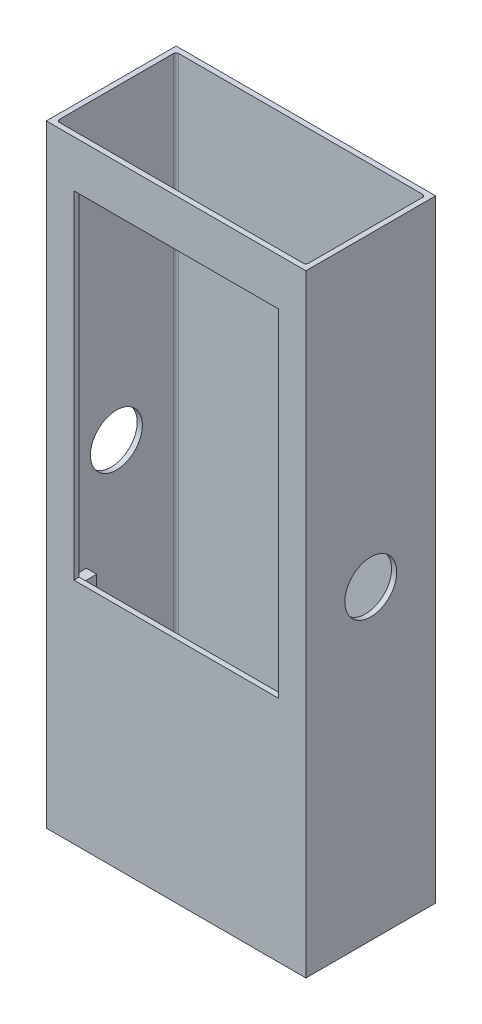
from build123d import *

# Parameters (mm, degrees)
SKETCH1_W               = 127
SKETCH1_H               = 63.5
BOSS_EXTRUDE1_DEPTH     = 302.26
SKETCH2_W               = 121.92
SKETCH2_H               = 58.42
CUT_EXTRUDE1_DEPTH      = 299.72
FILLET3_R               = 1.27
FILLET4_R               = 1.27
FILLET5_R               = 1.27
FILLET6_R               = 1.27
SKETCH3_R               = 12.7
CUT_EXTRUDE3_DEPTH      = 254
SKETCH4_W               = 127
SKETCH4_H               = 63.5
CUT_EXTRUDE4_DEPTH      = 2.54
CUT_EXTRUDE5_DEPTH      = 8.128
CUT_EXTRUDE5_DEPTH_BACK = 25.4
SKETCH5_W               = 100.000000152
SKETCH5_H               = 164.999999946
SKETCH6_R               = 1.600000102
BOSS_EXTRUDE3_DEPTH     = 8.000000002
BOSS_EXTRUDE4_DEPTH     = 7.99999924
BOSS_EXTRUDE5_DEPTH     = 7.99999924
BOSS_EXTRUDE6_DEPTH     = 7.99999924


with BuildPart() as part:
    # Sketch1 → Boss-Extrude1 (new body)
    with BuildSketch(Plane(origin=(0, 0, 0), x_dir=(1, 0, 0), z_dir=(0, 1, 0))):
        with Locations((63.5, 31.75)):
            Rectangle(SKETCH1_W, SKETCH1_H)
    extrude(amount=-BOSS_EXTRUDE1_DEPTH)

    # Sketch2 → Cut-Extrude1 (cut)
    with BuildSketch(Plane.XZ.offset(302.26)):
        with Locations((63.5, -31.75)):
            Rectangle(SKETCH2_W, SKETCH2_H)
    extrude(amount=-CUT_EXTRUDE1_DEPTH, mode=Mode.SUBTRACT)

    # Fillet3
    fillet3_edges = [part.edges().sort_by_distance(p)[0] for p in [
        (2.54, -152.4, -60.96),
    ]]
    fillet(fillet3_edges, radius=FILLET3_R)

    # Fillet4
    fillet4_edges = [part.edges().sort_by_distance(p)[0] for p in [
        (2.54, -152.4, -2.54),
    ]]
    fillet(fillet4_edges, radius=FILLET4_R)

    # Fillet5
    fillet5_edges = [part.edges().sort_by_distance(p)[0] for p in [
        (124.46, -152.4, -2.54),
    ]]
    fillet(fillet5_edges, radius=FILLET5_R)

    # Fillet6
    fillet6_edges = [part.edges().sort_by_distance(p)[0] for p in [
        (124.46, -152.4, -60.96),
    ]]
    fillet(fillet6_edges, radius=FILLET6_R)

    # Sketch3 → Cut-Extrude3 (cut)
    with BuildSketch(Plane.ZY):
        with Locations(Location((-31.75, -152.4, 0), (0, 0, 180))):
            Circle(SKETCH3_R)
    extrude(amount=-CUT_EXTRUDE3_DEPTH, mode=Mode.SUBTRACT)

    # Sketch4 → Cut-Extrude4 (cut)
    with BuildSketch(Plane(origin=(0, 0, 0), x_dir=(1, 0, 0), z_dir=(0, 1, 0))):
        with Locations((63.5, 31.75)):
            Rectangle(SKETCH4_W, SKETCH4_H)
    extrude(amount=-CUT_EXTRUDE4_DEPTH, mode=Mode.SUBTRACT)

    # Sketch5 → Cut-Extrude5 (cut, two sides: drawn at the far end of the back side and taken through both)
    with BuildSketch(Plane.XY.offset(-CUT_EXTRUDE5_DEPTH_BACK)):
        with Locations((63.5, -107.899999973)):
            Rectangle(SKETCH5_W, SKETCH5_H)
    extrude(amount=CUT_EXTRUDE5_DEPTH + CUT_EXTRUDE5_DEPTH_BACK, mode=Mode.SUBTRACT)

    # Sketch6 → Boss-Extrude3 (add)
    with BuildSketch(Plane(origin=(0, 0, -2.54), x_dir=(-1, 0, 0), z_dir=(0, 0, -1))):
        Polygon((-11.57603843, -17.860000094), (-9.03603843, -17.860000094), (-9.03603843, -22.940000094), (-14.11603843, -22.940000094), (-14.11603843, -17.860000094), align=None)
        with Locations((-11.57603843, -20.400000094)):
            Circle(SKETCH6_R, mode=Mode.SUBTRACT)
    extrude(amount=BOSS_EXTRUDE3_DEPTH)

    # Sketch8 → Boss-Extrude4 (add)
    with BuildSketch(Plane(origin=(0, 0, -2.54), x_dir=(-1, 0, 0), z_dir=(0, 0, -1))):
        with BuildLine():
            Line((-116.55537096, -19.268629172), (-117.964000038, -17.860000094))
            Line((-117.964000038, -17.860000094), (-117.964000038, -22.940000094))
            Line((-117.964000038, -22.940000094), (-116.55537096, -21.531371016))
            ThreePointArc((-116.55537096, -21.531371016), (-117.02400014, -20.400000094), (-116.55537096, -19.268629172))
        make_face()
        with BuildLine():
            Line((-114.292629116, -19.268629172), (-112.884000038, -17.860000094))
            Line((-112.884000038, -17.860000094), (-117.964000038, -17.860000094))
            Line((-117.964000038, -17.860000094), (-116.55537096, -19.268629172))
            ThreePointArc((-116.55537096, -19.268629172), (-115.424000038, -18.799999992), (-114.292629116, -19.268629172))
        make_face()
        with BuildLine():
            Line((-112.884000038, -22.940000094), (-112.884000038, -17.860000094))
            Line((-112.884000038, -17.860000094), (-114.292629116, -19.268629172))
            ThreePointArc((-114.292629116, -19.268629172), (-113.945792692, -19.787706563), (-113.823999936, -20.400000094))
            ThreePointArc((-113.823999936, -20.400000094), (-113.945792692, -21.012293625), (-114.292629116, -21.531371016))
            Line((-114.292629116, -21.531371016), (-112.884000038, -22.940000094))
        make_face()
        with BuildLine():
            Line((-117.964000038, -22.940000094), (-112.884000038, -22.940000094))
            Line((-112.884000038, -22.940000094), (-114.292629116, -21.531371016))
            ThreePointArc((-114.292629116, -21.531371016), (-115.424000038, -22.000000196), (-116.55537096, -21.531371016))
            Line((-116.55537096, -21.531371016), (-117.964000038, -22.940000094))
        make_face()
    extrude(amount=BOSS_EXTRUDE4_DEPTH)

    # Sketch10 → Boss-Extrude5 (add)
    with BuildSketch(Plane(origin=(0, 0, -2.54), x_dir=(-1, 0, 0), z_dir=(0, 0, -1))):
        with BuildLine():
            Line((-116.55537096, -194.26862893), (-117.964000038, -192.859999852))
            Line((-117.964000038, -192.859999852), (-117.964000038, -197.939999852))
            Line((-117.964000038, -197.939999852), (-116.55537096, -196.531370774))
            ThreePointArc((-116.55537096, -196.531370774), (-117.02400014, -195.399999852), (-116.55537096, -194.26862893))
        make_face()
        with BuildLine():
            Line((-112.884000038, -192.859999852), (-117.964000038, -192.859999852))
            Line((-117.964000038, -192.859999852), (-116.55537096, -194.26862893))
            ThreePointArc((-116.55537096, -194.26862893), (-115.424000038, -193.79999975), (-114.292629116, -194.26862893))
            Line((-114.292629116, -194.26862893), (-112.884000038, -192.859999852))
        make_face()
        with BuildLine():
            Line((-112.884000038, -197.939999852), (-112.884000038, -192.859999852))
            Line((-112.884000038, -192.859999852), (-114.292629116, -194.26862893))
            ThreePointArc((-114.292629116, -194.26862893), (-113.945792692, -194.787706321), (-113.823999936, -195.399999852))
            ThreePointArc((-113.823999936, -195.399999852), (-113.945792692, -196.012293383), (-114.292629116, -196.531370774))
            Line((-114.292629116, -196.531370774), (-112.884000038, -197.939999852))
        make_face()
        with BuildLine():
            Line((-116.55537096, -196.531370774), (-117.964000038, -197.939999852))
            Line((-117.964000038, -197.939999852), (-112.884000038, -197.939999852))
            Line((-112.884000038, -197.939999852), (-114.292629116, -196.531370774))
            ThreePointArc((-114.292629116, -196.531370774), (-115.424000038, -196.999999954), (-116.55537096, -196.531370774))
        make_face()
    extrude(amount=BOSS_EXTRUDE5_DEPTH)

    # Sketch11 → Boss-Extrude6 (add)
    with BuildSketch(Plane(origin=(0, 0, -2.54), x_dir=(-1, 0, 0), z_dir=(0, 0, -1))):
        with BuildLine():
            Line((-12.707370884, -194.26862893), (-14.115999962, -192.859999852))
            Line((-14.115999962, -192.859999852), (-14.115999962, -197.939999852))
            Line((-14.115999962, -197.939999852), (-12.707370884, -196.531370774))
            ThreePointArc((-12.707370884, -196.531370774), (-13.176000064, -195.399999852), (-12.707370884, -194.26862893))
        make_face()
        with BuildLine():
            Line((-9.035999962, -192.859999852), (-14.115999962, -192.859999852))
            Line((-14.115999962, -192.859999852), (-12.707370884, -194.26862893))
            ThreePointArc((-12.707370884, -194.26862893), (-11.575999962, -193.79999975), (-10.44462904, -194.26862893))
            Line((-10.44462904, -194.26862893), (-9.035999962, -192.859999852))
        make_face()
        with BuildLine():
            Line((-9.035999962, -197.939999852), (-9.035999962, -192.859999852))
            Line((-9.035999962, -192.859999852), (-10.44462904, -194.26862893))
            ThreePointArc((-10.44462904, -194.26862893), (-10.097792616, -194.787706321), (-9.97599986, -195.399999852))
            ThreePointArc((-9.97599986, -195.399999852), (-10.097792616, -196.012293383), (-10.44462904, -196.531370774))
            Line((-10.44462904, -196.531370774), (-9.035999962, -197.939999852))
        make_face()
        with BuildLine():
            Line((-12.707370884, -196.531370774), (-14.115999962, -197.939999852))
            Line((-14.115999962, -197.939999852), (-9.035999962, -197.939999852))
            Line((-9.035999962, -197.939999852), (-10.44462904, -196.531370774))
            ThreePointArc((-10.44462904, -196.531370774), (-11.575999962, -196.999999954), (-12.707370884, -196.531370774))
        make_face()
    extrude(amount=BOSS_EXTRUDE6_DEPTH)


solid = part.part
